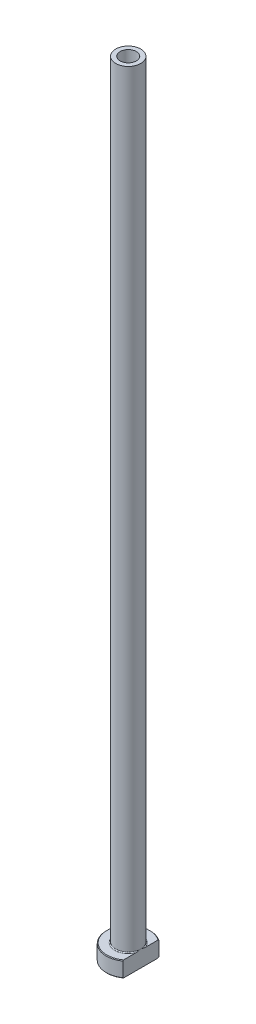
ISO-10303-21;
HEADER;
FILE_DESCRIPTION(('STEP AP214'),'2;1');
FILE_NAME('part.step','',(''),(''),'','','');
FILE_SCHEMA(('AUTOMOTIVE_DESIGN { 1 0 10303 214 1 1 1 1 }'));
ENDSEC;
DATA;
#1=APPLICATION_CONTEXT('core data for automotive mechanical design processes');
#2=APPLICATION_PROTOCOL_DEFINITION('international standard','automotive_design',2000,#1);
#3=PRODUCT_CONTEXT('',#1,'mechanical');
#4=PRODUCT('Part','Part','',(#3));
#5=PRODUCT_RELATED_PRODUCT_CATEGORY('part','',(#4));
#6=PRODUCT_DEFINITION_FORMATION('','',#4);
#7=PRODUCT_DEFINITION_CONTEXT('part definition',#1,'design');
#8=PRODUCT_DEFINITION('design','',#6,#7);
#9=PRODUCT_DEFINITION_SHAPE('','',#8);
#10=(LENGTH_UNIT() NAMED_UNIT(*) SI_UNIT(.MILLI.,.METRE.));
#11=(NAMED_UNIT(*) PLANE_ANGLE_UNIT() SI_UNIT($,.RADIAN.));
#12=(NAMED_UNIT(*) SI_UNIT($,.STERADIAN.) SOLID_ANGLE_UNIT());
#13=UNCERTAINTY_MEASURE_WITH_UNIT(LENGTH_MEASURE(1.E-05),#10,'distance_accuracy_value','');
#14=(GEOMETRIC_REPRESENTATION_CONTEXT(3) GLOBAL_UNCERTAINTY_ASSIGNED_CONTEXT((#13)) GLOBAL_UNIT_ASSIGNED_CONTEXT((#10,
#11,#12)) REPRESENTATION_CONTEXT('',''));
#15=CARTESIAN_POINT('',(0.,0.,0.));
#16=DIRECTION('',(0.,0.,1.));
#17=DIRECTION('',(1.,0.,0.));
#18=AXIS2_PLACEMENT_3D('',#15,#16,#17);
#19=CARTESIAN_POINT('',(0.,92.1876809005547,0.));
#20=DIRECTION('',(0.,1.,0.));
#21=DIRECTION('',(0.,0.,1.));
#22=AXIS2_PLACEMENT_3D('',#19,#20,#21);
#23=CYLINDRICAL_SURFACE('',#22,2.60000000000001);
#24=CARTESIAN_POINT('',(0.,250.,0.));
#25=DIRECTION('',(0.,1.,0.));
#26=DIRECTION('',(0.,0.,1.));
#27=AXIS2_PLACEMENT_3D('',#24,#25,#26);
#28=CIRCLE('',#27,2.60000000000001);
#29=CARTESIAN_POINT('',(0.,250.,2.60000000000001));
#30=VERTEX_POINT('',#29);
#31=EDGE_CURVE('E167',#30,#30,#28,.T.);
#32=ORIENTED_EDGE('',*,*,#31,.T.);
#33=EDGE_LOOP('',(#32));
#34=FACE_BOUND('',#33,.T.);
#35=CARTESIAN_POINT('',(0.,205.,0.));
#36=DIRECTION('',(0.,1.,0.));
#37=DIRECTION('',(0.,0.,1.));
#38=AXIS2_PLACEMENT_3D('',#35,#36,#37);
#39=CIRCLE('',#38,2.60000000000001);
#40=CARTESIAN_POINT('',(0.,205.,2.60000000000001));
#41=VERTEX_POINT('',#40);
#42=EDGE_CURVE('E170',#41,#41,#39,.T.);
#43=ORIENTED_EDGE('',*,*,#42,.F.);
#44=EDGE_LOOP('',(#43));
#45=FACE_BOUND('',#44,.T.);
#46=ADVANCED_FACE('F32',(#34,#45),#23,.F.);
#47=CARTESIAN_POINT('',(-2.60000000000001,250.,0.));
#48=DIRECTION('',(0.,1.,0.));
#49=DIRECTION('',(0.,0.,1.));
#50=AXIS2_PLACEMENT_3D('',#47,#48,#49);
#51=PLANE('',#50);
#52=CARTESIAN_POINT('',(0.,250.,0.));
#53=DIRECTION('',(0.,1.,0.));
#54=DIRECTION('',(0.,0.,1.));
#55=AXIS2_PLACEMENT_3D('',#52,#53,#54);
#56=CIRCLE('',#55,4.00000000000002);
#57=CARTESIAN_POINT('',(0.,250.,4.00000000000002));
#58=VERTEX_POINT('',#57);
#59=EDGE_CURVE('E174',#58,#58,#56,.T.);
#60=ORIENTED_EDGE('',*,*,#59,.T.);
#61=EDGE_LOOP('',(#60));
#62=FACE_BOUND('',#61,.T.);
#63=ORIENTED_EDGE('',*,*,#31,.F.);
#64=EDGE_LOOP('',(#63));
#65=FACE_BOUND('',#64,.T.);
#66=ADVANCED_FACE('F157',(#62,#65),#51,.T.);
#67=CARTESIAN_POINT('',(0.,92.1876809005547,0.));
#68=DIRECTION('',(0.,1.,0.));
#69=DIRECTION('',(0.,0.,1.));
#70=AXIS2_PLACEMENT_3D('',#67,#68,#69);
#71=CYLINDRICAL_SURFACE('',#70,4.);
#72=CARTESIAN_POINT('',(0.,5.3,0.));
#73=DIRECTION('',(0.,1.,0.));
#74=DIRECTION('',(0.,0.,1.));
#75=AXIS2_PLACEMENT_3D('',#72,#73,#74);
#76=CIRCLE('',#75,4.);
#77=CARTESIAN_POINT('',(4.,5.3,0.));
#78=VERTEX_POINT('',#77);
#79=EDGE_CURVE('E180',#78,#78,#76,.T.);
#80=ORIENTED_EDGE('',*,*,#79,.T.);
#81=EDGE_LOOP('',(#80));
#82=FACE_BOUND('',#81,.T.);
#83=ORIENTED_EDGE('',*,*,#59,.F.);
#84=EDGE_LOOP('',(#83));
#85=FACE_BOUND('',#84,.T.);
#86=ADVANCED_FACE('F162',(#82,#85),#71,.T.);
#87=CARTESIAN_POINT('',(-3.99999999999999,5.,0.));
#88=DIRECTION('',(0.,1.,0.));
#89=DIRECTION('',(0.,0.,1.));
#90=AXIS2_PLACEMENT_3D('',#87,#88,#89);
#91=PLANE('',#90);
#92=DIRECTION('',(0.,0.,1.));
#93=VECTOR('',#92,1.);
#94=CARTESIAN_POINT('',(4.,5.,0.));
#95=LINE('',#94,#93);
#96=CARTESIAN_POINT('',(4.,5.,-5.49909083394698));
#97=VERTEX_POINT('',#96);
#98=CARTESIAN_POINT('',(4.,5.,-1.57797338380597));
#99=VERTEX_POINT('',#98);
#100=EDGE_CURVE('E54',#97,#99,#95,.T.);
#101=ORIENTED_EDGE('',*,*,#100,.F.);
#102=CARTESIAN_POINT('',(0.,5.,0.));
#103=DIRECTION('',(0.,1.,0.));
#104=DIRECTION('',(0.,0.,1.));
#105=AXIS2_PLACEMENT_3D('',#102,#103,#104);
#106=CIRCLE('',#105,6.79999999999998);
#107=CARTESIAN_POINT('',(3.99999999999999,5.,5.49909083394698));
#108=VERTEX_POINT('',#107);
#109=EDGE_CURVE('E186',#97,#108,#106,.T.);
#110=ORIENTED_EDGE('',*,*,#109,.T.);
#111=CARTESIAN_POINT('',(4.,5.,1.57797338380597));
#112=VERTEX_POINT('',#111);
#113=EDGE_CURVE('E134',#112,#108,#95,.T.);
#114=ORIENTED_EDGE('',*,*,#113,.F.);
#115=CARTESIAN_POINT('',(0.,5.,0.));
#116=DIRECTION('',(0.,1.,0.));
#117=DIRECTION('',(0.,0.,1.));
#118=AXIS2_PLACEMENT_3D('',#115,#116,#117);
#119=CIRCLE('',#118,4.3);
#120=EDGE_CURVE('E183',#112,#99,#119,.F.);
#121=ORIENTED_EDGE('',*,*,#120,.T.);
#122=EDGE_LOOP('',(#101,#110,#114,#121));
#123=FACE_BOUND('',#122,.T.);
#124=ADVANCED_FACE('F197',(#123),#91,.T.);
#125=CARTESIAN_POINT('',(0.,92.1876809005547,0.));
#126=DIRECTION('',(0.,1.,0.));
#127=DIRECTION('',(0.,0.,1.));
#128=AXIS2_PLACEMENT_3D('',#125,#126,#127);
#129=CYLINDRICAL_SURFACE('',#128,6.99999999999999);
#130=DIRECTION('',(0.,-1.,0.));
#131=VECTOR('',#130,1.);
#132=CARTESIAN_POINT('',(3.99999999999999,250.,5.74456264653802));
#133=LINE('',#132,#131);
#134=CARTESIAN_POINT('',(3.99999999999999,4.8,5.74456264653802));
#135=VERTEX_POINT('',#134);
#136=CARTESIAN_POINT('',(3.99999999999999,0.199999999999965,5.74456264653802));
#137=VERTEX_POINT('',#136);
#138=EDGE_CURVE('E82',#135,#137,#133,.T.);
#139=ORIENTED_EDGE('',*,*,#138,.F.);
#140=CARTESIAN_POINT('',(0.,4.8,0.));
#141=DIRECTION('',(0.,1.,0.));
#142=DIRECTION('',(0.,0.,1.));
#143=AXIS2_PLACEMENT_3D('',#140,#141,#142);
#144=CIRCLE('',#143,6.99999999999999);
#145=CARTESIAN_POINT('',(4.,4.8,-5.74456264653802));
#146=VERTEX_POINT('',#145);
#147=EDGE_CURVE('E95',#135,#146,#144,.F.);
#148=ORIENTED_EDGE('',*,*,#147,.T.);
#149=DIRECTION('',(0.,-1.,0.));
#150=VECTOR('',#149,1.);
#151=CARTESIAN_POINT('',(4.,250.,-5.74456264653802));
#152=LINE('',#151,#150);
#153=CARTESIAN_POINT('',(4.,0.199999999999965,-5.74456264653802));
#154=VERTEX_POINT('',#153);
#155=EDGE_CURVE('E192',#146,#154,#152,.T.);
#156=ORIENTED_EDGE('',*,*,#155,.T.);
#157=CARTESIAN_POINT('',(0.,0.199999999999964,0.));
#158=DIRECTION('',(0.,-1.,0.));
#159=DIRECTION('',(0.,0.,-1.));
#160=AXIS2_PLACEMENT_3D('',#157,#158,#159);
#161=CIRCLE('',#160,6.99999999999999);
#162=EDGE_CURVE('E98',#154,#137,#161,.F.);
#163=ORIENTED_EDGE('',*,*,#162,.T.);
#164=EDGE_LOOP('',(#139,#148,#156,#163));
#165=FACE_BOUND('',#164,.T.);
#166=ADVANCED_FACE('F190',(#165),#129,.T.);
#167=CARTESIAN_POINT('',(-6.99999999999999,0.,0.));
#168=DIRECTION('',(0.,-1.,0.));
#169=DIRECTION('',(0.,0.,-1.));
#170=AXIS2_PLACEMENT_3D('',#167,#168,#169);
#171=PLANE('',#170);
#172=CARTESIAN_POINT('',(0.,0.,0.));
#173=DIRECTION('',(0.,-1.,0.));
#174=DIRECTION('',(0.,0.,-1.));
#175=AXIS2_PLACEMENT_3D('',#172,#173,#174);
#176=CIRCLE('',#175,3.34999999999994);
#177=CARTESIAN_POINT('',(0.,0.,-3.34999999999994));
#178=VERTEX_POINT('',#177);
#179=EDGE_CURVE('E40',#178,#178,#176,.F.);
#180=ORIENTED_EDGE('',*,*,#179,.T.);
#181=EDGE_LOOP('',(#180));
#182=FACE_BOUND('',#181,.T.);
#183=DIRECTION('',(0.,0.,-1.));
#184=VECTOR('',#183,1.);
#185=CARTESIAN_POINT('',(3.99999999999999,0.,5.74456264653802));
#186=LINE('',#185,#184);
#187=CARTESIAN_POINT('',(3.99999999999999,0.,5.49909083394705));
#188=VERTEX_POINT('',#187);
#189=CARTESIAN_POINT('',(4.,0.,-5.49909083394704));
#190=VERTEX_POINT('',#189);
#191=EDGE_CURVE('E47',#188,#190,#186,.T.);
#192=ORIENTED_EDGE('',*,*,#191,.F.);
#193=CARTESIAN_POINT('',(0.,0.,0.));
#194=DIRECTION('',(0.,-1.,0.));
#195=DIRECTION('',(0.,0.,-1.));
#196=AXIS2_PLACEMENT_3D('',#193,#194,#195);
#197=CIRCLE('',#196,6.80000000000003);
#198=EDGE_CURVE('E92',#188,#190,#197,.T.);
#199=ORIENTED_EDGE('',*,*,#198,.T.);
#200=EDGE_LOOP('',(#192,#199));
#201=FACE_BOUND('',#200,.T.);
#202=ADVANCED_FACE('F91',(#182,#201),#171,.T.);
#203=CARTESIAN_POINT('',(0.,92.1876809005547,0.));
#204=DIRECTION('',(0.,1.,0.));
#205=DIRECTION('',(0.,0.,1.));
#206=AXIS2_PLACEMENT_3D('',#203,#204,#205);
#207=CYLINDRICAL_SURFACE('',#206,2.85);
#208=CARTESIAN_POINT('',(0.,0.499999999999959,0.));
#209=DIRECTION('',(0.,-1.,0.));
#210=DIRECTION('',(0.,0.,-1.));
#211=AXIS2_PLACEMENT_3D('',#208,#209,#210);
#212=CIRCLE('',#211,2.85);
#213=CARTESIAN_POINT('',(0.,0.499999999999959,-2.85));
#214=VERTEX_POINT('',#213);
#215=EDGE_CURVE('E11',#214,#214,#212,.T.);
#216=ORIENTED_EDGE('',*,*,#215,.T.);
#217=EDGE_LOOP('',(#216));
#218=FACE_BOUND('',#217,.T.);
#219=CARTESIAN_POINT('',(0.,193.,0.));
#220=DIRECTION('',(0.,1.,0.));
#221=DIRECTION('',(0.,0.,1.));
#222=AXIS2_PLACEMENT_3D('',#219,#220,#221);
#223=CIRCLE('',#222,2.85000000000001);
#224=CARTESIAN_POINT('',(0.,193.,2.85000000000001));
#225=VERTEX_POINT('',#224);
#226=EDGE_CURVE('E172',#225,#225,#223,.T.);
#227=ORIENTED_EDGE('',*,*,#226,.T.);
#228=EDGE_LOOP('',(#227));
#229=FACE_BOUND('',#228,.T.);
#230=ADVANCED_FACE('F215',(#218,#229),#207,.F.);
#231=CARTESIAN_POINT('',(0.,193.,0.));
#232=DIRECTION('',(0.,-1.,0.));
#233=DIRECTION('',(0.,0.,-1.));
#234=AXIS2_PLACEMENT_3D('',#231,#232,#233);
#235=CONICAL_SURFACE('',#234,2.85000000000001,0.0208303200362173);
#236=ORIENTED_EDGE('',*,*,#42,.T.);
#237=EDGE_LOOP('',(#236));
#238=FACE_BOUND('',#237,.T.);
#239=ORIENTED_EDGE('',*,*,#226,.F.);
#240=EDGE_LOOP('',(#239));
#241=FACE_BOUND('',#240,.T.);
#242=ADVANCED_FACE('F111',(#238,#241),#235,.F.);
#243=CARTESIAN_POINT('',(0.,5.3,0.));
#244=DIRECTION('',(0.,1.,0.));
#245=DIRECTION('',(0.,0.,1.));
#246=AXIS2_PLACEMENT_3D('',#243,#244,#245);
#247=TOROIDAL_SURFACE('',#246,4.3,0.3);
#248=ORIENTED_EDGE('',*,*,#120,.F.);
#249=CARTESIAN_POINT('',(4.,5.3,0.));
#250=CARTESIAN_POINT('',(4.,5.30000062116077,-1.06261193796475E-10));
#251=CARTESIAN_POINT('',(4.,5.30000124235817,2.17726143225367E-07));
#252=CARTESIAN_POINT('',(4.,5.30000240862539,8.36141170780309E-07));
#253=CARTESIAN_POINT('',(4.,5.30000294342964,1.25011700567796E-06));
#254=CARTESIAN_POINT('',(4.,5.30000404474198,2.23959365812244E-06));
#255=CARTESIAN_POINT('',(4.,5.3000045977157,2.83084496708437E-06));
#256=CARTESIAN_POINT('',(4.,5.3000055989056,4.0651664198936E-06));
#257=CARTESIAN_POINT('',(4.,5.3000060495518,4.70640119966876E-06));
#258=CARTESIAN_POINT('',(4.,5.30000769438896,7.15677270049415E-06));
#259=CARTESIAN_POINT('',(4.,5.30000879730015,9.02996055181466E-06));
#260=CARTESIAN_POINT('',(4.,5.30001063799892,1.27664896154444E-05));
#261=CARTESIAN_POINT('',(4.,5.30001139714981,1.46197814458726E-05));
#262=CARTESIAN_POINT('',(4.,5.30001453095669,2.23679236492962E-05));
#263=CARTESIAN_POINT('',(4.,5.30001683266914,2.8296876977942E-05));
#264=CARTESIAN_POINT('',(4.,5.30002027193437,3.95668753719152E-05));
#265=CARTESIAN_POINT('',(4.,5.30002152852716,4.48715482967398E-05));
#266=CARTESIAN_POINT('',(3.99999999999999,5.30003060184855,8.40118234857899E-05));
#267=CARTESIAN_POINT('',(3.99999999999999,5.30003739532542,0.000118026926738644));
#268=CARTESIAN_POINT('',(4.,5.3000671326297,0.000252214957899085));
#269=CARTESIAN_POINT('',(4.,5.30009559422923,0.0003511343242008));
#270=CARTESIAN_POINT('',(3.99999999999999,5.30020622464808,0.000742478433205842));
#271=CARTESIAN_POINT('',(3.99999999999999,5.30028475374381,0.00103561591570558));
#272=CARTESIAN_POINT('',(4.,5.30059889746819,0.0021992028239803));
#273=CARTESIAN_POINT('',(4.,5.30083905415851,0.00306873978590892));
#274=CARTESIAN_POINT('',(3.99999999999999,5.30183682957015,0.00669141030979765));
#275=CARTESIAN_POINT('',(3.99999999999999,5.30258877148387,0.00944568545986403));
#276=CARTESIAN_POINT('',(4.00000000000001,5.31066890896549,0.0390293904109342));
#277=CARTESIAN_POINT('',(4.,5.31802631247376,0.0658531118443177));
#278=CARTESIAN_POINT('',(3.99999999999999,5.33239676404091,0.118441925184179));
#279=CARTESIAN_POINT('',(3.99999999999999,5.33941183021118,0.144206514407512));
#280=CARTESIAN_POINT('',(4.,5.35427366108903,0.199017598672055));
#281=CARTESIAN_POINT('',(4.,5.3621131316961,0.228066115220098));
#282=CARTESIAN_POINT('',(4.,5.37776349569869,0.286511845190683));
#283=CARTESIAN_POINT('',(4.,5.38557313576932,0.315909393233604));
#284=CARTESIAN_POINT('',(4.,5.40425662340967,0.386994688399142));
#285=CARTESIAN_POINT('',(4.,5.41505237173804,0.428703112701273));
#286=CARTESIAN_POINT('',(4.,5.43592310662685,0.511098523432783));
#287=CARTESIAN_POINT('',(4.,5.44600969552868,0.551782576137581));
#288=CARTESIAN_POINT('',(4.,5.47850986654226,0.686599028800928));
#289=CARTESIAN_POINT('',(4.,5.49978370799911,0.781011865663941));
#290=CARTESIAN_POINT('',(4.,5.53807543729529,0.97184761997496));
#291=CARTESIAN_POINT('',(4.,5.55504273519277,1.0682812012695));
#292=CARTESIAN_POINT('',(4.,5.57582405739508,1.21752725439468));
#293=CARTESIAN_POINT('',(4.,5.58209796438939,1.2699937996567));
#294=CARTESIAN_POINT('',(4.,5.59210686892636,1.37516324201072));
#295=CARTESIAN_POINT('',(4.,5.59584265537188,1.42786606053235));
#296=CARTESIAN_POINT('',(4.,5.60010438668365,1.53310673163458));
#297=CARTESIAN_POINT('',(4.,5.6006487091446,1.58564378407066));
#298=CARTESIAN_POINT('',(4.,5.59767158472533,1.69058605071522));
#299=CARTESIAN_POINT('',(4.,5.59415502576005,1.74299134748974));
#300=CARTESIAN_POINT('',(4.,5.58503062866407,1.81903290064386));
#301=CARTESIAN_POINT('',(4.,5.58157617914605,1.84292934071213));
#302=CARTESIAN_POINT('',(4.,5.57329952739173,1.89051061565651));
#303=CARTESIAN_POINT('',(4.,5.56847619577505,1.91419525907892));
#304=CARTESIAN_POINT('',(4.,5.55726644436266,1.96092888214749));
#305=CARTESIAN_POINT('',(4.,5.55089740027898,1.98398195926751));
#306=CARTESIAN_POINT('',(4.,5.53623434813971,2.0294555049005));
#307=CARTESIAN_POINT('',(4.,5.52794253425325,2.05187666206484));
#308=CARTESIAN_POINT('',(4.,5.50887098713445,2.09590631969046));
#309=CARTESIAN_POINT('',(4.,5.49806837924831,2.11750508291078));
#310=CARTESIAN_POINT('',(4.,5.47333401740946,2.15885583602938));
#311=CARTESIAN_POINT('',(4.,5.45941272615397,2.17861369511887));
#312=CARTESIAN_POINT('',(4.,5.43588221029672,2.20522942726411));
#313=CARTESIAN_POINT('',(4.,5.42781139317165,2.21344043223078));
#314=CARTESIAN_POINT('',(4.,5.41065114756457,2.22875149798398));
#315=CARTESIAN_POINT('',(4.,5.40156129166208,2.23585108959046));
#316=CARTESIAN_POINT('',(4.,5.38220524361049,2.24859694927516));
#317=CARTESIAN_POINT('',(4.,5.3719242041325,2.25422119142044));
#318=CARTESIAN_POINT('',(4.,5.35045072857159,2.26331064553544));
#319=CARTESIAN_POINT('',(4.,5.33926122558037,2.26678251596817));
#320=CARTESIAN_POINT('',(4.,5.31952044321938,2.27051268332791));
#321=CARTESIAN_POINT('',(4.,5.31108453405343,2.27139016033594));
#322=CARTESIAN_POINT('',(4.,5.29418624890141,2.27168963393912));
#323=CARTESIAN_POINT('',(4.,5.28572387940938,2.27111196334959));
#324=CARTESIAN_POINT('',(4.,5.26904138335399,2.26855580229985));
#325=CARTESIAN_POINT('',(4.,5.26082066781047,2.26658107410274));
#326=CARTESIAN_POINT('',(4.,5.24478214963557,2.26139496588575));
#327=CARTESIAN_POINT('',(4.,5.23696461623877,2.25818277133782));
#328=CARTESIAN_POINT('',(4.,5.21851235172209,2.24908332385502));
#329=CARTESIAN_POINT('',(4.,5.20815219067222,2.24264095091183));
#330=CARTESIAN_POINT('',(4.,5.18857975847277,2.22819957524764));
#331=CARTESIAN_POINT('',(4.,5.17937061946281,2.22019647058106));
#332=CARTESIAN_POINT('',(4.,5.15665383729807,2.19777756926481));
#333=CARTESIAN_POINT('',(4.,5.14403484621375,2.18246908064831));
#334=CARTESIAN_POINT('',(4.,5.12118369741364,2.15020843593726));
#335=CARTESIAN_POINT('',(4.,5.11095480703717,2.13325407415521));
#336=CARTESIAN_POINT('',(4.,5.09273574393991,2.09892324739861));
#337=CARTESIAN_POINT('',(4.,5.08468212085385,2.08157988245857));
#338=CARTESIAN_POINT('',(4.,5.07005901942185,2.04627072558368));
#339=CARTESIAN_POINT('',(4.,5.06349101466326,2.02830433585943));
#340=CARTESIAN_POINT('',(4.,5.04555485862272,1.97350761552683));
#341=CARTESIAN_POINT('',(4.,5.03608974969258,1.93605770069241));
#342=CARTESIAN_POINT('',(4.,5.01780569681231,1.84529235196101));
#343=CARTESIAN_POINT('',(4.,5.01077018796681,1.79164082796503));
#344=CARTESIAN_POINT('',(4.,5.00182846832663,1.68379947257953));
#345=CARTESIAN_POINT('',(4.,4.99993887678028,1.62960846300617));
#346=CARTESIAN_POINT('',(4.,5.00006129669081,1.52361204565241));
#347=CARTESIAN_POINT('',(4.,5.00190698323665,1.47180551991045));
#348=CARTESIAN_POINT('',(4.,5.00841243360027,1.36835357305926));
#349=CARTESIAN_POINT('',(4.,5.01307376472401,1.31670825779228));
#350=CARTESIAN_POINT('',(4.,5.02905484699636,1.17431887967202));
#351=CARTESIAN_POINT('',(4.,5.04274090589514,1.08384207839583));
#352=CARTESIAN_POINT('',(4.,5.06701714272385,0.947757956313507));
#353=CARTESIAN_POINT('',(4.,5.07585573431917,0.901814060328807));
#354=CARTESIAN_POINT('',(4.,5.09458665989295,0.810008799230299));
#355=CARTESIAN_POINT('',(4.,5.10448180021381,0.76414800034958));
#356=CARTESIAN_POINT('',(4.,5.12892434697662,0.655631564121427));
#357=CARTESIAN_POINT('',(3.99999999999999,5.14383556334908,0.593058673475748));
#358=CARTESIAN_POINT('',(4.,5.17458762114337,0.46888522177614));
#359=CARTESIAN_POINT('',(4.,5.19041623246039,0.407281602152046));
#360=CARTESIAN_POINT('',(3.99999999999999,5.22090834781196,0.291232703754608));
#361=CARTESIAN_POINT('',(3.99999999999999,5.23550024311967,0.236768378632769));
#362=CARTESIAN_POINT('',(4.,5.26562550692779,0.125604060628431));
#363=CARTESIAN_POINT('',(4.00000000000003,5.28117250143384,0.0689076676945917));
#364=CARTESIAN_POINT('',(3.99999999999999,5.29741226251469,0.00944154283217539));
#365=CARTESIAN_POINT('',(3.99999999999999,5.2981654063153,0.00668315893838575));
#366=CARTESIAN_POINT('',(4.,5.29916346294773,0.00305954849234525));
#367=CARTESIAN_POINT('',(4.,5.29940273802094,0.0021931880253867));
#368=CARTESIAN_POINT('',(3.99999999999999,5.29971580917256,0.00103357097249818));
#369=CARTESIAN_POINT('',(3.99999999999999,5.29979412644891,0.000741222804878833));
#370=CARTESIAN_POINT('',(4.,5.29990450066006,0.000350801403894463));
#371=CARTESIAN_POINT('',(4.,5.29993292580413,0.000252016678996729));
#372=CARTESIAN_POINT('',(3.99999999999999,5.29996263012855,0.000117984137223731));
#373=CARTESIAN_POINT('',(3.99999999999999,5.29996941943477,8.39881926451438E-05));
#374=CARTESIAN_POINT('',(4.,5.29997848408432,4.48674032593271E-05));
#375=CARTESIAN_POINT('',(4.,5.29997973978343,3.95638208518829E-05));
#376=CARTESIAN_POINT('',(4.,5.29998317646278,2.82960353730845E-05));
#377=CARTESIAN_POINT('',(4.,5.29998547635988,2.23681467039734E-05));
#378=CARTESIAN_POINT('',(4.,5.29998860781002,1.46211007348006E-05));
#379=CARTESIAN_POINT('',(4.,5.29998936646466,1.27678906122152E-05));
#380=CARTESIAN_POINT('',(4.,5.29999120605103,9.03144106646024E-06));
#381=CARTESIAN_POINT('',(4.,5.29999230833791,7.15824128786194E-06));
#382=CARTESIAN_POINT('',(4.,5.29999395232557,4.70775547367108E-06));
#383=CARTESIAN_POINT('',(4.,5.29999440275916,4.066464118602E-06));
#384=CARTESIAN_POINT('',(4.,5.29999540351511,2.83199114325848E-06));
#385=CARTESIAN_POINT('',(4.,5.29999595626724,2.24064366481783E-06));
#386=CARTESIAN_POINT('',(4.,5.29999705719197,1.25093989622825E-06));
#387=CARTESIAN_POINT('',(4.,5.29999759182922,8.36841224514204E-07));
#388=CARTESIAN_POINT('',(4.,5.29999875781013,2.18117823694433E-07));
#389=CARTESIAN_POINT('',(4.,5.29999937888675,1.0625427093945E-10));
#390=CARTESIAN_POINT('',(4.,5.3,0.));
#391=B_SPLINE_CURVE_WITH_KNOTS('',3,(#249,#250,#251,#252,#253,#254,#255,#256,#257,#258,#259,
#260,#261,#262,#263,#264,#265,#266,#267,#268,#269,#270,#271,#272,#273,#274,#275,#276,#277,#278,
#279,#280,#281,#282,#283,#284,#285,#286,#287,#288,#289,#290,#291,#292,#293,#294,#295,#296,#297,
#298,#299,#300,#301,#302,#303,#304,#305,#306,#307,#308,#309,#310,#311,#312,#313,#314,#315,#316,
#317,#318,#319,#320,#321,#322,#323,#324,#325,#326,#327,#328,#329,#330,#331,#332,#333,#334,#335,
#336,#337,#338,#339,#340,#341,#342,#343,#344,#345,#346,#347,#348,#349,#350,#351,#352,#353,#354,
#355,#356,#357,#358,#359,#360,#361,#362,#363,#364,#365,#366,#367,#368,#369,#370,#371,#372,#373,
#374,#375,#376,#377,#378,#379,#380,#381,#382,#383,#384,#385,#386,#387,#388,#389,#390),
.UNSPECIFIED.,.T.,.F.,(4,2,2,2,2,2,2,2,2,2,2,2,2,2,2,2,2,2,2,2,2,2,2,2,2,2,2,2,2,2,2,2,2,2,2,2,
2,2,2,2,2,2,2,2,2,2,2,2,2,2,2,2,2,2,2,2,2,2,2,2,2,2,2,2,2,2,2,2,2,2,4),(0.,1.87484342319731E-06,
3.90179894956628E-06,6.31683679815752E-06,8.66651777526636E-06,1.51627533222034E-05,
2.11657906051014E-05,4.02090751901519E-05,5.65429439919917E-05,0.000160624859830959,
0.000469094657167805,0.00137985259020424,0.00408571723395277,0.0126514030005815,
0.0960918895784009,0.176200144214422,0.266463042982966,0.357714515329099,0.486961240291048,
0.612707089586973,0.902988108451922,1.19653589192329,1.35501075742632,1.51343634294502,
1.67094875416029,1.82827177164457,1.90067591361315,1.97313996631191,2.04482437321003,
2.11642737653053,2.18871023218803,2.26075412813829,2.29521947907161,2.32969934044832,
2.36466792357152,2.39952778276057,2.42485422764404,2.45017488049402,2.47542760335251,
2.50069697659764,2.53708899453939,2.57357798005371,2.63276032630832,2.69202310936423,
2.74930315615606,2.8066397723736,2.92223125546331,3.08420752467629,3.24670629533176,
3.40212850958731,3.5576373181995,3.8319296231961,3.97228382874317,4.1130205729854,
4.30598130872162,4.49678885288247,4.66594443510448,4.842306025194,4.85088453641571,
4.85358051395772,4.8544888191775,4.85479687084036,4.85490089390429,4.85491722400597,
4.85493626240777,4.85494226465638,4.85494875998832,4.85495110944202,4.85495352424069,
4.85495555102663,4.8549574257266),.UNSPECIFIED.);
#392=EDGE_CURVE('E126',#112,#78,#391,.T.);
#393=ORIENTED_EDGE('',*,*,#392,.T.);
#394=ORIENTED_EDGE('',*,*,#79,.F.);
#395=CARTESIAN_POINT('',(4.,5.3,0.));
#396=CARTESIAN_POINT('',(4.,5.29999937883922,1.06262399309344E-10));
#397=CARTESIAN_POINT('',(4.,5.29999875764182,-2.17726141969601E-07));
#398=CARTESIAN_POINT('',(4.,5.29999759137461,-8.36141169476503E-07));
#399=CARTESIAN_POINT('',(4.,5.29999705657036,-1.25011700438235E-06));
#400=CARTESIAN_POINT('',(4.,5.29999595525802,-2.23959365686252E-06));
#401=CARTESIAN_POINT('',(4.,5.2999954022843,-2.83084496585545E-06));
#402=CARTESIAN_POINT('',(4.,5.29999440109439,-4.06516641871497E-06));
#403=CARTESIAN_POINT('',(4.,5.2999939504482,-4.70640119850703E-06));
#404=CARTESIAN_POINT('',(4.,5.29999230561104,-7.15677269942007E-06));
#405=CARTESIAN_POINT('',(4.,5.29999120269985,-9.02996055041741E-06));
#406=CARTESIAN_POINT('',(4.,5.29998936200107,-1.2766489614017E-05));
#407=CARTESIAN_POINT('',(4.,5.29998860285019,-1.46197814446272E-05));
#408=CARTESIAN_POINT('',(4.,5.29998546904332,-2.23679236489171E-05));
#409=CARTESIAN_POINT('',(4.,5.29998316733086,-2.82968769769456E-05));
#410=CARTESIAN_POINT('',(4.,5.29997972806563,-3.95668753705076E-05));
#411=CARTESIAN_POINT('',(4.,5.29997847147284,-4.48715482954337E-05));
#412=CARTESIAN_POINT('',(3.99999999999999,5.29996939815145,-8.40118234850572E-05));
#413=CARTESIAN_POINT('',(3.99999999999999,5.29996260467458,-0.000118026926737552));
#414=CARTESIAN_POINT('',(4.,5.2999328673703,-0.000252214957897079));
#415=CARTESIAN_POINT('',(4.,5.29990440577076,-0.000351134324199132));
#416=CARTESIAN_POINT('',(3.99999999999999,5.29979377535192,-0.000742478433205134));
#417=CARTESIAN_POINT('',(3.99999999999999,5.29971524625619,-0.00103561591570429));
#418=CARTESIAN_POINT('',(4.,5.2994011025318,-0.00219920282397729));
#419=CARTESIAN_POINT('',(4.,5.29916094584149,-0.00306873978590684));
#420=CARTESIAN_POINT('',(3.99999999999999,5.29816317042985,-0.00669141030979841));
#421=CARTESIAN_POINT('',(3.99999999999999,5.29741122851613,-0.00944568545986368));
#422=CARTESIAN_POINT('',(4.00000000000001,5.28933109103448,-0.0390293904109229));
#423=CARTESIAN_POINT('',(4.,5.28197368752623,-0.065853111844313));
#424=CARTESIAN_POINT('',(3.99999999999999,5.2676032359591,-0.11844192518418));
#425=CARTESIAN_POINT('',(3.99999999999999,5.26058816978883,-0.144206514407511));
#426=CARTESIAN_POINT('',(4.,5.24572633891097,-0.199017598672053));
#427=CARTESIAN_POINT('',(4.,5.2378868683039,-0.228066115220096));
#428=CARTESIAN_POINT('',(4.,5.22223650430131,-0.286511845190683));
#429=CARTESIAN_POINT('',(4.,5.21442686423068,-0.315909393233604));
#430=CARTESIAN_POINT('',(4.,5.19574337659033,-0.386994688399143));
#431=CARTESIAN_POINT('',(4.,5.18494762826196,-0.428703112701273));
#432=CARTESIAN_POINT('',(4.,5.16407689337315,-0.511098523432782));
#433=CARTESIAN_POINT('',(4.,5.15399030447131,-0.55178257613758));
#434=CARTESIAN_POINT('',(4.,5.12149013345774,-0.686599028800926));
#435=CARTESIAN_POINT('',(4.,5.10021629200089,-0.781011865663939));
#436=CARTESIAN_POINT('',(4.,5.06192456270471,-0.971847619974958));
#437=CARTESIAN_POINT('',(4.,5.04495726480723,-1.06828120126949));
#438=CARTESIAN_POINT('',(4.,5.02417594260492,-1.21752725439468));
#439=CARTESIAN_POINT('',(4.,5.01790203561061,-1.2699937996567));
#440=CARTESIAN_POINT('',(4.,5.00789313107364,-1.37516324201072));
#441=CARTESIAN_POINT('',(4.,5.00415734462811,-1.42786606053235));
#442=CARTESIAN_POINT('',(4.,4.99989561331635,-1.53310673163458));
#443=CARTESIAN_POINT('',(4.,4.9993512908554,-1.58564378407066));
#444=CARTESIAN_POINT('',(4.,5.00232841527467,-1.69058605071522));
#445=CARTESIAN_POINT('',(4.,5.00584497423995,-1.74299134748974));
#446=CARTESIAN_POINT('',(4.,5.01496937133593,-1.81903290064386));
#447=CARTESIAN_POINT('',(4.,5.01842382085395,-1.84292934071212));
#448=CARTESIAN_POINT('',(4.,5.02670047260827,-1.89051061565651));
#449=CARTESIAN_POINT('',(4.,5.03152380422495,-1.91419525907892));
#450=CARTESIAN_POINT('',(4.,5.04273355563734,-1.96092888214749));
#451=CARTESIAN_POINT('',(4.,5.04910259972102,-1.98398195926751));
#452=CARTESIAN_POINT('',(4.,5.06376565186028,-2.02945550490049));
#453=CARTESIAN_POINT('',(4.,5.07205746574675,-2.05187666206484));
#454=CARTESIAN_POINT('',(4.,5.09112901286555,-2.09590631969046));
#455=CARTESIAN_POINT('',(4.,5.10193162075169,-2.11750508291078));
#456=CARTESIAN_POINT('',(4.,5.12666598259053,-2.15885583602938));
#457=CARTESIAN_POINT('',(4.,5.14058727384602,-2.17861369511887));
#458=CARTESIAN_POINT('',(4.,5.16411778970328,-2.20522942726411));
#459=CARTESIAN_POINT('',(4.,5.17218860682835,-2.21344043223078));
#460=CARTESIAN_POINT('',(4.,5.18934885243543,-2.22875149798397));
#461=CARTESIAN_POINT('',(4.,5.19843870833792,-2.23585108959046));
#462=CARTESIAN_POINT('',(4.,5.21779475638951,-2.24859694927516));
#463=CARTESIAN_POINT('',(4.,5.2280757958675,-2.25422119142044));
#464=CARTESIAN_POINT('',(4.,5.24954927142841,-2.26331064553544));
#465=CARTESIAN_POINT('',(4.,5.26073877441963,-2.26678251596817));
#466=CARTESIAN_POINT('',(4.,5.28047955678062,-2.27051268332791));
#467=CARTESIAN_POINT('',(4.,5.28891546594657,-2.27139016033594));
#468=CARTESIAN_POINT('',(4.,5.30581375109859,-2.27168963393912));
#469=CARTESIAN_POINT('',(4.,5.31427612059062,-2.27111196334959));
#470=CARTESIAN_POINT('',(4.,5.33095861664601,-2.26855580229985));
#471=CARTESIAN_POINT('',(4.,5.33917933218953,-2.26658107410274));
#472=CARTESIAN_POINT('',(4.,5.35521785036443,-2.26139496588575));
#473=CARTESIAN_POINT('',(4.,5.36303538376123,-2.25818277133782));
#474=CARTESIAN_POINT('',(4.,5.38148764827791,-2.24908332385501));
#475=CARTESIAN_POINT('',(4.,5.39184780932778,-2.24264095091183));
#476=CARTESIAN_POINT('',(4.,5.41142024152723,-2.22819957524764));
#477=CARTESIAN_POINT('',(4.,5.42062938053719,-2.22019647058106));
#478=CARTESIAN_POINT('',(4.,5.44334616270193,-2.19777756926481));
#479=CARTESIAN_POINT('',(4.,5.45596515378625,-2.18246908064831));
#480=CARTESIAN_POINT('',(4.,5.47881630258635,-2.15020843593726));
#481=CARTESIAN_POINT('',(4.,5.48904519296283,-2.13325407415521));
#482=CARTESIAN_POINT('',(4.,5.50726425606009,-2.09892324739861));
#483=CARTESIAN_POINT('',(4.,5.51531787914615,-2.08157988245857));
#484=CARTESIAN_POINT('',(4.,5.52994098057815,-2.04627072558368));
#485=CARTESIAN_POINT('',(4.,5.53650898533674,-2.02830433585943));
#486=CARTESIAN_POINT('',(4.,5.55444514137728,-1.97350761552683));
#487=CARTESIAN_POINT('',(4.,5.56391025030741,-1.9360577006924));
#488=CARTESIAN_POINT('',(4.,5.58219430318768,-1.845292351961));
#489=CARTESIAN_POINT('',(4.,5.58922981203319,-1.79164082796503));
#490=CARTESIAN_POINT('',(4.,5.59817153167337,-1.68379947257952));
#491=CARTESIAN_POINT('',(4.,5.60006112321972,-1.62960846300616));
#492=CARTESIAN_POINT('',(4.,5.59993870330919,-1.5236120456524));
#493=CARTESIAN_POINT('',(4.,5.59809301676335,-1.47180551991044));
#494=CARTESIAN_POINT('',(4.,5.59158756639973,-1.36835357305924));
#495=CARTESIAN_POINT('',(4.,5.58692623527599,-1.31670825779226));
#496=CARTESIAN_POINT('',(4.,5.57094515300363,-1.17431887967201));
#497=CARTESIAN_POINT('',(4.,5.55725909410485,-1.08384207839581));
#498=CARTESIAN_POINT('',(4.,5.53298285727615,-0.947757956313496));
#499=CARTESIAN_POINT('',(4.,5.52414426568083,-0.901814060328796));
#500=CARTESIAN_POINT('',(4.,5.50541334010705,-0.810008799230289));
#501=CARTESIAN_POINT('',(4.,5.49551819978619,-0.76414800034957));
#502=CARTESIAN_POINT('',(4.,5.47107565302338,-0.655631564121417));
#503=CARTESIAN_POINT('',(3.99999999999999,5.45616443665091,-0.593058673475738));
#504=CARTESIAN_POINT('',(4.,5.42541237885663,-0.468885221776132));
#505=CARTESIAN_POINT('',(4.,5.40958376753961,-0.407281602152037));
#506=CARTESIAN_POINT('',(3.99999999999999,5.37909165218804,-0.2912327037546));
#507=CARTESIAN_POINT('',(3.99999999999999,5.36449975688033,-0.236768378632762));
#508=CARTESIAN_POINT('',(4.,5.33437449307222,-0.125604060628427));
#509=CARTESIAN_POINT('',(4.00000000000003,5.31882749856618,-0.0689076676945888));
#510=CARTESIAN_POINT('',(3.99999999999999,5.30258773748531,-0.00944154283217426));
#511=CARTESIAN_POINT('',(3.99999999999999,5.30183459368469,-0.00668315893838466));
#512=CARTESIAN_POINT('',(4.,5.30083653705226,-0.0030595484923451));
#513=CARTESIAN_POINT('',(4.,5.30059726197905,-0.00219318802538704));
#514=CARTESIAN_POINT('',(3.99999999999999,5.30028419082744,-0.00103357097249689));
#515=CARTESIAN_POINT('',(3.99999999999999,5.30020587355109,-0.000741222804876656));
#516=CARTESIAN_POINT('',(4.,5.30009549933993,-0.000350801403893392));
#517=CARTESIAN_POINT('',(4.,5.30006707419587,-0.000252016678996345));
#518=CARTESIAN_POINT('',(3.99999999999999,5.30003736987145,-0.000117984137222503));
#519=CARTESIAN_POINT('',(3.99999999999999,5.30003058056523,-8.3988192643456E-05));
#520=CARTESIAN_POINT('',(4.,5.30002151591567,-4.48674032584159E-05));
#521=CARTESIAN_POINT('',(4.,5.30002026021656,-3.95638208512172E-05));
#522=CARTESIAN_POINT('',(4.,5.30001682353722,-2.82960353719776E-05));
#523=CARTESIAN_POINT('',(4.,5.30001452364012,-2.23681467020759E-05));
#524=CARTESIAN_POINT('',(4.,5.30001139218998,-1.46211007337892E-05));
#525=CARTESIAN_POINT('',(4.,5.30001063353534,-1.27678906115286E-05));
#526=CARTESIAN_POINT('',(4.,5.30000879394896,-9.03144106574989E-06));
#527=CARTESIAN_POINT('',(4.,5.30000769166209,-7.15824128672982E-06));
#528=CARTESIAN_POINT('',(4.,5.30000604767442,-4.70775547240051E-06));
#529=CARTESIAN_POINT('',(4.,5.30000559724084,-4.06646411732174E-06));
#530=CARTESIAN_POINT('',(4.,5.30000459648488,-2.83199114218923E-06));
#531=CARTESIAN_POINT('',(4.,5.30000404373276,-2.24064366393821E-06));
#532=CARTESIAN_POINT('',(4.,5.30000294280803,-1.25093989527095E-06));
#533=CARTESIAN_POINT('',(4.,5.30000240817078,-8.36841223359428E-07));
#534=CARTESIAN_POINT('',(4.,5.30000124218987,-2.18117822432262E-07));
#535=CARTESIAN_POINT('',(4.,5.30000062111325,-1.06253060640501E-10));
#536=CARTESIAN_POINT('',(4.,5.3,0.));
#537=B_SPLINE_CURVE_WITH_KNOTS('',3,(#395,#396,#397,#398,#399,#400,#401,#402,#403,#404,#405,
#406,#407,#408,#409,#410,#411,#412,#413,#414,#415,#416,#417,#418,#419,#420,#421,#422,#423,#424,
#425,#426,#427,#428,#429,#430,#431,#432,#433,#434,#435,#436,#437,#438,#439,#440,#441,#442,#443,
#444,#445,#446,#447,#448,#449,#450,#451,#452,#453,#454,#455,#456,#457,#458,#459,#460,#461,#462,
#463,#464,#465,#466,#467,#468,#469,#470,#471,#472,#473,#474,#475,#476,#477,#478,#479,#480,#481,
#482,#483,#484,#485,#486,#487,#488,#489,#490,#491,#492,#493,#494,#495,#496,#497,#498,#499,#500,
#501,#502,#503,#504,#505,#506,#507,#508,#509,#510,#511,#512,#513,#514,#515,#516,#517,#518,#519,
#520,#521,#522,#523,#524,#525,#526,#527,#528,#529,#530,#531,#532,#533,#534,#535,#536),
.UNSPECIFIED.,.T.,.F.,(4,2,2,2,2,2,2,2,2,2,2,2,2,2,2,2,2,2,2,2,2,2,2,2,2,2,2,2,2,2,2,2,2,2,2,2,
2,2,2,2,2,2,2,2,2,2,2,2,2,2,2,2,2,2,2,2,2,2,2,2,2,2,2,2,2,2,2,2,2,2,4),(0.,1.87484342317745E-06,
3.90179894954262E-06,6.31683679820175E-06,8.66651777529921E-06,1.5162753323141E-05,
2.11657906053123E-05,4.02090751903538E-05,5.65429439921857E-05,0.000160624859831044,
0.000469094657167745,0.00137985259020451,0.0040857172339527,0.0126514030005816,
0.0960918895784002,0.17620014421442,0.266463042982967,0.357714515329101,0.48696124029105,
0.612707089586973,0.902988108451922,1.19653589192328,1.35501075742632,1.51343634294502,
1.67094875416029,1.82827177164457,1.90067591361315,1.97313996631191,2.04482437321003,
2.11642737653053,2.18871023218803,2.26075412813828,2.29521947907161,2.32969934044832,
2.36466792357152,2.39952778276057,2.42485422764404,2.45017488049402,2.47542760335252,
2.50069697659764,2.53708899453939,2.57357798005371,2.63276032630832,2.69202310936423,
2.74930315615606,2.8066397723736,2.92223125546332,3.08420752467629,3.24670629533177,
3.40212850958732,3.55763731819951,3.83192962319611,3.97228382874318,4.1130205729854,
4.30598130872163,4.49678885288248,4.66594443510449,4.842306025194,4.85088453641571,
4.85358051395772,4.8544888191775,4.85479687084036,4.85490089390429,4.85491722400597,
4.85493626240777,4.85494226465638,4.85494875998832,4.85495110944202,4.85495352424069,
4.85495555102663,4.8549574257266),.UNSPECIFIED.);
#538=EDGE_CURVE('E135',#78,#99,#537,.T.);
#539=ORIENTED_EDGE('',*,*,#538,.T.);
#540=EDGE_LOOP('',(#248,#393,#394,#539));
#541=FACE_BOUND('',#540,.T.);
#542=ADVANCED_FACE('F141',(#541),#247,.F.);
#543=CARTESIAN_POINT('',(0.,5.,0.));
#544=DIRECTION('',(0.,-1.,0.));
#545=DIRECTION('',(0.,0.,-1.));
#546=AXIS2_PLACEMENT_3D('',#543,#544,#545);
#547=CONICAL_SURFACE('',#546,6.79999999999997,0.785398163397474);
#548=CARTESIAN_POINT('',(4.,-1.45712845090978,-12.6392822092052));
#549=CARTESIAN_POINT('',(4.,-1.24364466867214,-12.4153556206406));
#550=CARTESIAN_POINT('',(4.,-1.03042430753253,-12.1911774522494));
#551=CARTESIAN_POINT('',(4.,-0.604617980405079,-11.7422167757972));
#552=CARTESIAN_POINT('',(4.,-0.392032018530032,-11.5174342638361));
#553=CARTESIAN_POINT('',(4.,0.0324624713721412,-11.0670952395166));
#554=CARTESIAN_POINT('',(4.,0.244370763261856,-10.8415385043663));
#555=CARTESIAN_POINT('',(4.,0.667290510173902,-10.3895875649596));
#556=CARTESIAN_POINT('',(4.,0.878301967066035,-10.1631933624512));
#557=CARTESIAN_POINT('',(4.,1.5138537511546,-9.47810122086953));
#558=CARTESIAN_POINT('',(4.,1.93676291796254,-9.01788214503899));
#559=CARTESIAN_POINT('',(4.,2.56612335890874,-8.32309905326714));
#560=CARTESIAN_POINT('',(4.,2.77505666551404,-8.0907845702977));
#561=CARTESIAN_POINT('',(4.,3.19080254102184,-7.62426940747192));
#562=CARTESIAN_POINT('',(4.,3.39761512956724,-7.39006874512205));
#563=CARTESIAN_POINT('',(4.,3.87870763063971,-6.838918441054));
#564=CARTESIAN_POINT('',(4.,4.15190978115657,-6.52102188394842));
#565=CARTESIAN_POINT('',(4.,4.55642425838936,-6.03960901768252));
#566=CARTESIAN_POINT('',(4.,4.69041050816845,-5.87833992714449));
#567=CARTESIAN_POINT('',(4.,4.95616531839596,-5.5539846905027));
#568=CARTESIAN_POINT('',(4.,5.08793391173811,-5.39089857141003));
#569=CARTESIAN_POINT('',(4.,5.34841712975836,-5.06288801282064));
#570=CARTESIAN_POINT('',(4.,5.47713786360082,-4.89796843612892));
#571=CARTESIAN_POINT('',(4.,5.73107494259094,-4.56545535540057));
#572=CARTESIAN_POINT('',(4.,5.85629144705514,-4.39786197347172));
#573=CARTESIAN_POINT('',(4.,6.10211465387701,-4.05948444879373));
#574=CARTESIAN_POINT('',(4.,6.22272435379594,-3.8887024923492));
#575=CARTESIAN_POINT('',(4.,6.45796076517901,-3.54308312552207));
#576=CARTESIAN_POINT('',(4.,6.57258867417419,-3.36824653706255));
#577=CARTESIAN_POINT('',(4.,6.76866603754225,-3.05381396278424));
#578=CARTESIAN_POINT('',(4.,6.85173773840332,-2.91523359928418));
#579=CARTESIAN_POINT('',(4.,7.01174537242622,-2.63451965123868));
#580=CARTESIAN_POINT('',(4.,7.0886804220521,-2.49238555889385));
#581=CARTESIAN_POINT('',(4.,7.2345943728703,-2.20416961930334));
#582=CARTESIAN_POINT('',(4.,7.30357836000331,-2.05809037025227));
#583=CARTESIAN_POINT('',(4.,7.43135520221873,-1.76151732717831));
#584=CARTESIAN_POINT('',(4.,7.49015114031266,-1.61102488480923));
#585=CARTESIAN_POINT('',(4.,7.58249315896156,-1.34142099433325));
#586=CARTESIAN_POINT('',(4.,7.61872660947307,-1.22323501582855));
#587=CARTESIAN_POINT('',(4.,7.68223354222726,-0.98449286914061));
#588=CARTESIAN_POINT('',(4.,7.70951040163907,-0.863937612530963));
#589=CARTESIAN_POINT('',(4.,7.75377914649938,-0.621342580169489));
#590=CARTESIAN_POINT('',(4.,7.77080509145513,-0.499309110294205));
#591=CARTESIAN_POINT('',(4.,7.79378778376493,-0.254194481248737));
#592=CARTESIAN_POINT('',(4.,7.79974523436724,-0.131113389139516));
#593=CARTESIAN_POINT('',(4.,7.80023957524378,0.115517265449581));
#594=CARTESIAN_POINT('',(4.,7.79473514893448,0.239066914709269));
#595=CARTESIAN_POINT('',(4.,7.77255119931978,0.485148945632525));
#596=CARTESIAN_POINT('',(4.,7.75587091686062,0.607681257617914));
#597=CARTESIAN_POINT('',(4.,7.71218353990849,0.851269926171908));
#598=CARTESIAN_POINT('',(4.,7.68514362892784,0.972320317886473));
#599=CARTESIAN_POINT('',(4.,7.6220120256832,1.21200276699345));
#600=CARTESIAN_POINT('',(4.,7.58591962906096,1.33063463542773));
#601=CARTESIAN_POINT('',(4.,7.4598007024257,1.70122439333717));
#602=CARTESIAN_POINT('',(4.,7.35572950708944,1.94843335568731));
#603=CARTESIAN_POINT('',(4.,7.18186715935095,2.31048534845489));
#604=CARTESIAN_POINT('',(4.,7.12087684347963,2.42983561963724));
#605=CARTESIAN_POINT('',(4.,6.99403531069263,2.66593629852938));
#606=CARTESIAN_POINT('',(3.99999999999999,6.92818466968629,2.78268701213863));
#607=CARTESIAN_POINT('',(3.99999999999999,6.79157875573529,3.01550895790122));
#608=CARTESIAN_POINT('',(3.99999999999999,6.72076681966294,3.13154660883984));
#609=CARTESIAN_POINT('',(3.99999999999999,6.57583116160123,3.36153379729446));
#610=CARTESIAN_POINT('',(3.99999999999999,6.50170736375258,3.47548328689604));
#611=CARTESIAN_POINT('',(3.99999999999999,6.35080982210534,3.70145107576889));
#612=CARTESIAN_POINT('',(3.99999999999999,6.27403866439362,3.81347110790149));
#613=CARTESIAN_POINT('',(3.99999999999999,6.11824120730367,4.03592316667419));
#614=CARTESIAN_POINT('',(3.99999999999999,6.03921496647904,4.14635523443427));
#615=CARTESIAN_POINT('',(3.99999999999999,5.81506547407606,4.45397159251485));
#616=CARTESIAN_POINT('',(3.99999999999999,5.66782256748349,4.64961120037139));
#617=CARTESIAN_POINT('',(3.99999999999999,5.36880597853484,5.03740600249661));
#618=CARTESIAN_POINT('',(3.99999999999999,5.21703183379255,5.22956083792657));
#619=CARTESIAN_POINT('',(3.99999999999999,4.90999105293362,5.61115465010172));
#620=CARTESIAN_POINT('',(3.99999999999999,4.75472331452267,5.80059273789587));
#621=CARTESIAN_POINT('',(3.99999999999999,4.4415075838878,6.17724364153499));
#622=CARTESIAN_POINT('',(3.99999999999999,4.28355951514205,6.36445639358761));
#623=CARTESIAN_POINT('',(3.99999999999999,3.9652580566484,6.73740614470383));
#624=CARTESIAN_POINT('',(3.99999999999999,3.80490084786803,6.92313987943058));
#625=CARTESIAN_POINT('',(3.99999999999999,3.48247055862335,7.29311320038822));
#626=CARTESIAN_POINT('',(3.99999999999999,3.32039746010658,7.47735277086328));
#627=CARTESIAN_POINT('',(3.99999999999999,2.83216188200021,8.02814826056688));
#628=CARTESIAN_POINT('',(3.99999999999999,2.50391696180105,8.39285790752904));
#629=CARTESIAN_POINT('',(3.99999999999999,1.87512078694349,9.08414492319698));
#630=CARTESIAN_POINT('',(3.99999999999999,1.57491666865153,9.41103929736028));
#631=CARTESIAN_POINT('',(3.99999999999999,0.972153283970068,10.0626830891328));
#632=CARTESIAN_POINT('',(3.99999999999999,0.669593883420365,10.3874323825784));
#633=CARTESIAN_POINT('',(3.99999999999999,0.0637759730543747,11.0341169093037));
#634=CARTESIAN_POINT('',(3.99999999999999,-0.239476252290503,11.3560580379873));
#635=CARTESIAN_POINT('',(3.99999999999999,-0.847356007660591,11.9985921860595));
#636=CARTESIAN_POINT('',(3.99999999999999,-1.15198342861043,12.3191853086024));
#637=CARTESIAN_POINT('',(3.99999999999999,-1.45712845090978,12.6392822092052));
#638=B_SPLINE_CURVE_WITH_KNOTS('',3,(#548,#549,#550,#551,#552,#553,#554,#555,#556,#557,#558,
#559,#560,#561,#562,#563,#564,#565,#566,#567,#568,#569,#570,#571,#572,#573,#574,#575,#576,#577,
#578,#579,#580,#581,#582,#583,#584,#585,#586,#587,#588,#589,#590,#591,#592,#593,#594,#595,#596,
#597,#598,#599,#600,#601,#602,#603,#604,#605,#606,#607,#608,#609,#610,#611,#612,#613,#614,#615,
#616,#617,#618,#619,#620,#621,#622,#623,#624,#625,#626,#627,#628,#629,#630,#631,#632,#633,#634,
#635,#636,#637),.UNSPECIFIED.,.F.,.F.,(4,2,2,2,2,2,2,2,2,2,2,2,2,2,2,2,2,2,2,2,2,2,2,2,2,2,2,2,
2,2,2,2,2,2,2,2,2,2,2,2,2,2,2,2,4),(0.,0.928152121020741,1.85631024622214,2.78476262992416,
3.71321307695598,5.5882303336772,6.52556078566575,7.46288254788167,8.72028576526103,
9.349270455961,9.97824580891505,10.6058302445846,11.2333861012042,11.8605264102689,
12.4875406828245,12.9721363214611,13.4568016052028,13.9411551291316,14.4253618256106,
14.7959147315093,15.1663277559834,15.535503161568,15.9046551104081,16.2751400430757,
16.645650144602,17.017343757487,17.3890663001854,18.1913996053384,18.5934522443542,
18.9954573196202,19.4032100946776,19.8109722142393,20.218346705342,20.6257106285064,
21.3601838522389,22.0947322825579,22.829515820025,23.5643203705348,24.3004480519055,
25.0365834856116,26.508549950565,27.8400191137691,29.1715646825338,30.4983881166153,
31.8251080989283),.UNSPECIFIED.);
#639=EDGE_CURVE('E133',#146,#97,#638,.T.);
#640=ORIENTED_EDGE('',*,*,#639,.F.);
#641=ORIENTED_EDGE('',*,*,#147,.F.);
#642=EDGE_CURVE('E118',#108,#135,#638,.T.);
#643=ORIENTED_EDGE('',*,*,#642,.F.);
#644=ORIENTED_EDGE('',*,*,#109,.F.);
#645=EDGE_LOOP('',(#640,#641,#643,#644));
#646=FACE_BOUND('',#645,.T.);
#647=ADVANCED_FACE('F145',(#646),#547,.T.);
#648=CARTESIAN_POINT('',(0.,0.199999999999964,0.));
#649=DIRECTION('',(0.,1.,0.));
#650=DIRECTION('',(0.,0.,1.));
#651=AXIS2_PLACEMENT_3D('',#648,#649,#650);
#652=CONICAL_SURFACE('',#651,6.99999999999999,0.78539816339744);
#653=CARTESIAN_POINT('',(3.99999999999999,6.45712845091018,12.6392822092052));
#654=CARTESIAN_POINT('',(3.99999999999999,6.24364466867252,12.4153556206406));
#655=CARTESIAN_POINT('',(3.99999999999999,6.0304243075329,12.1911774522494));
#656=CARTESIAN_POINT('',(3.99999999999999,5.60461798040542,11.7422167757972));
#657=CARTESIAN_POINT('',(3.99999999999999,5.39203201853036,11.5174342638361));
#658=CARTESIAN_POINT('',(3.99999999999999,4.96753752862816,11.0670952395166));
#659=CARTESIAN_POINT('',(3.99999999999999,4.75562923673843,10.8415385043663));
#660=CARTESIAN_POINT('',(3.99999999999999,4.33270948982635,10.3895875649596));
#661=CARTESIAN_POINT('',(3.99999999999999,4.12169803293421,10.1631933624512));
#662=CARTESIAN_POINT('',(3.99999999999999,3.4861462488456,9.47810122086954));
#663=CARTESIAN_POINT('',(3.99999999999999,3.06323708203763,9.01788214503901));
#664=CARTESIAN_POINT('',(3.99999999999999,2.43387664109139,8.32309905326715));
#665=CARTESIAN_POINT('',(3.99999999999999,2.22494333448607,8.09078457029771));
#666=CARTESIAN_POINT('',(3.99999999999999,1.80919745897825,7.62426940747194));
#667=CARTESIAN_POINT('',(3.99999999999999,1.60238487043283,7.39006874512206));
#668=CARTESIAN_POINT('',(3.99999999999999,1.12129236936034,6.83891844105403));
#669=CARTESIAN_POINT('',(3.99999999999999,0.848090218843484,6.52102188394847));
#670=CARTESIAN_POINT('',(3.99999999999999,0.443575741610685,6.0396090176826));
#671=CARTESIAN_POINT('',(3.99999999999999,0.309589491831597,5.87833992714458));
#672=CARTESIAN_POINT('',(3.99999999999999,0.0438346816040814,5.55398469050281));
#673=CARTESIAN_POINT('',(3.99999999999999,-0.0879339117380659,5.39089857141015));
#674=CARTESIAN_POINT('',(3.99999999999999,-0.348417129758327,5.06288801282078));
#675=CARTESIAN_POINT('',(3.99999999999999,-0.477137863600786,4.89796843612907));
#676=CARTESIAN_POINT('',(3.99999999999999,-0.731074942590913,4.56545535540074));
#677=CARTESIAN_POINT('',(3.99999999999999,-0.856291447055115,4.3978619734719));
#678=CARTESIAN_POINT('',(3.99999999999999,-1.10211465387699,4.05948444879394));
#679=CARTESIAN_POINT('',(3.99999999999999,-1.22272435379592,3.88870249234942));
#680=CARTESIAN_POINT('',(3.99999999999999,-1.457960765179,3.54308312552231));
#681=CARTESIAN_POINT('',(3.99999999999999,-1.57258867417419,3.3682465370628));
#682=CARTESIAN_POINT('',(3.99999999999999,-1.76866603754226,3.05381396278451));
#683=CARTESIAN_POINT('',(4.,-1.85173773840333,2.91523359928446));
#684=CARTESIAN_POINT('',(4.,-2.01174537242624,2.63451965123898));
#685=CARTESIAN_POINT('',(4.,-2.08868042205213,2.49238555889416));
#686=CARTESIAN_POINT('',(4.,-2.23459437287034,2.20416961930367));
#687=CARTESIAN_POINT('',(4.,-2.30357836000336,2.05809037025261));
#688=CARTESIAN_POINT('',(4.,-2.4313552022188,1.76151732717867));
#689=CARTESIAN_POINT('',(4.,-2.49015114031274,1.61102488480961));
#690=CARTESIAN_POINT('',(4.,-2.58249315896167,1.34142099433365));
#691=CARTESIAN_POINT('',(4.,-2.61872660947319,1.22323501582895));
#692=CARTESIAN_POINT('',(4.,-2.6822335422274,0.984492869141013));
#693=CARTESIAN_POINT('',(4.,-2.70951040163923,0.863937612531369));
#694=CARTESIAN_POINT('',(4.,-2.75377914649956,0.621342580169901));
#695=CARTESIAN_POINT('',(4.,-2.77080509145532,0.499309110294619));
#696=CARTESIAN_POINT('',(4.,-2.79378778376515,0.254194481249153));
#697=CARTESIAN_POINT('',(4.,-2.79974523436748,0.131113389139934));
#698=CARTESIAN_POINT('',(4.,-2.80023957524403,-0.115517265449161));
#699=CARTESIAN_POINT('',(4.,-2.79473514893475,-0.23906691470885));
#700=CARTESIAN_POINT('',(4.,-2.77255119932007,-0.485148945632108));
#701=CARTESIAN_POINT('',(4.,-2.75587091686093,-0.6076812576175));
#702=CARTESIAN_POINT('',(4.,-2.71218353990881,-0.851269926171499));
#703=CARTESIAN_POINT('',(4.,-2.68514362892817,-0.972320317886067));
#704=CARTESIAN_POINT('',(4.,-2.62201202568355,-1.21200276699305));
#705=CARTESIAN_POINT('',(4.,-2.58591962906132,-1.33063463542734));
#706=CARTESIAN_POINT('',(4.,-2.4598007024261,-1.70122439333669));
#707=CARTESIAN_POINT('',(4.,-2.35572950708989,-1.94843335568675));
#708=CARTESIAN_POINT('',(4.,-2.18186715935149,-2.31048534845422));
#709=CARTESIAN_POINT('',(4.,-2.1208768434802,-2.42983561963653));
#710=CARTESIAN_POINT('',(4.,-1.99403531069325,-2.6659362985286));
#711=CARTESIAN_POINT('',(4.,-1.92818466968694,-2.78268701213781));
#712=CARTESIAN_POINT('',(4.,-1.79157875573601,-3.01550895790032));
#713=CARTESIAN_POINT('',(4.,-1.72076681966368,-3.13154660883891));
#714=CARTESIAN_POINT('',(4.,-1.57583116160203,-3.36153379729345));
#715=CARTESIAN_POINT('',(4.,-1.50170736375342,-3.475483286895));
#716=CARTESIAN_POINT('',(4.,-1.35080982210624,-3.70145107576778));
#717=CARTESIAN_POINT('',(4.,-1.27403866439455,-3.81347110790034));
#718=CARTESIAN_POINT('',(4.,-1.11824120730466,-4.03592316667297));
#719=CARTESIAN_POINT('',(4.,-1.03921496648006,-4.14635523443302));
#720=CARTESIAN_POINT('',(4.,-0.815065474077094,-4.45397159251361));
#721=CARTESIAN_POINT('',(4.,-0.667822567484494,-4.6496112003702));
#722=CARTESIAN_POINT('',(4.,-0.368805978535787,-5.03740600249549));
#723=CARTESIAN_POINT('',(4.,-0.217031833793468,-5.22956083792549));
#724=CARTESIAN_POINT('',(4.,0.0900089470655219,-5.61115465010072));
#725=CARTESIAN_POINT('',(4.,0.245276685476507,-5.80059273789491));
#726=CARTESIAN_POINT('',(4.,0.558492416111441,-6.1772436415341));
#727=CARTESIAN_POINT('',(4.,0.716440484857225,-6.36445639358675));
#728=CARTESIAN_POINT('',(4.,1.03474194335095,-6.73740614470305));
#729=CARTESIAN_POINT('',(4.,1.19509915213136,-6.92313987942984));
#730=CARTESIAN_POINT('',(4.,1.51752944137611,-7.29311320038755));
#731=CARTESIAN_POINT('',(4.,1.67960253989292,-7.47735277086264));
#732=CARTESIAN_POINT('',(4.,2.16783811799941,-8.02814826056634));
#733=CARTESIAN_POINT('',(4.,2.49608303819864,-8.39285790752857));
#734=CARTESIAN_POINT('',(4.,3.12487921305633,-9.08414492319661));
#735=CARTESIAN_POINT('',(4.,3.42508333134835,-9.41103929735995));
#736=CARTESIAN_POINT('',(4.,4.02784671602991,-10.0626830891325));
#737=CARTESIAN_POINT('',(4.,4.33040611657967,-10.3874323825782));
#738=CARTESIAN_POINT('',(4.,4.93622402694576,-11.0341169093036));
#739=CARTESIAN_POINT('',(4.,5.23947625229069,-11.3560580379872));
#740=CARTESIAN_POINT('',(4.,5.84735600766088,-11.9985921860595));
#741=CARTESIAN_POINT('',(4.,6.15198342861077,-12.3191853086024));
#742=CARTESIAN_POINT('',(4.,6.45712845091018,-12.6392822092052));
#743=B_SPLINE_CURVE_WITH_KNOTS('',3,(#653,#654,#655,#656,#657,#658,#659,#660,#661,#662,#663,
#664,#665,#666,#667,#668,#669,#670,#671,#672,#673,#674,#675,#676,#677,#678,#679,#680,#681,#682,
#683,#684,#685,#686,#687,#688,#689,#690,#691,#692,#693,#694,#695,#696,#697,#698,#699,#700,#701,
#702,#703,#704,#705,#706,#707,#708,#709,#710,#711,#712,#713,#714,#715,#716,#717,#718,#719,#720,
#721,#722,#723,#724,#725,#726,#727,#728,#729,#730,#731,#732,#733,#734,#735,#736,#737,#738,#739,
#740,#741,#742),.UNSPECIFIED.,.F.,.F.,(4,2,2,2,2,2,2,2,2,2,2,2,2,2,2,2,2,2,2,2,2,2,2,2,2,2,2,2,
2,2,2,2,2,2,2,2,2,2,2,2,2,2,2,2,4),(0.,0.928152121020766,1.8563102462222,2.78476262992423,
3.71321307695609,5.58823033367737,6.52556078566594,7.46288254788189,8.72028576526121,
9.34927045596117,9.97824580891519,10.6058302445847,11.2333861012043,11.860526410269,
12.4875406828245,12.9721363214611,13.4568016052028,13.9411551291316,14.4253618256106,
14.7959147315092,15.1663277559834,15.535503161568,15.9046551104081,16.2751400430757,
16.645650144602,17.017343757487,17.3890663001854,18.1913996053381,18.5934522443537,
18.9954573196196,19.4032100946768,19.8109722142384,20.218346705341,20.6257106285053,
21.3601838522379,22.0947322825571,22.8295158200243,23.5643203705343,24.3004480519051,
25.0365834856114,26.5085499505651,27.8400191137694,29.1715646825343,30.4983881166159,
31.8251080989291),.UNSPECIFIED.);
#744=EDGE_CURVE('E79',#137,#188,#743,.T.);
#745=ORIENTED_EDGE('',*,*,#744,.F.);
#746=ORIENTED_EDGE('',*,*,#162,.F.);
#747=EDGE_CURVE('E87',#190,#154,#743,.T.);
#748=ORIENTED_EDGE('',*,*,#747,.F.);
#749=ORIENTED_EDGE('',*,*,#198,.F.);
#750=EDGE_LOOP('',(#745,#746,#748,#749));
#751=FACE_BOUND('',#750,.T.);
#752=ADVANCED_FACE('F94',(#751),#652,.T.);
#753=CARTESIAN_POINT('',(3.99999999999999,250.,5.74456264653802));
#754=DIRECTION('',(-1.,0.,0.));
#755=DIRECTION('',(0.,0.,1.));
#756=AXIS2_PLACEMENT_3D('',#753,#754,#755);
#757=PLANE('',#756);
#758=ORIENTED_EDGE('',*,*,#392,.F.);
#759=ORIENTED_EDGE('',*,*,#113,.T.);
#760=ORIENTED_EDGE('',*,*,#642,.T.);
#761=ORIENTED_EDGE('',*,*,#138,.T.);
#762=ORIENTED_EDGE('',*,*,#744,.T.);
#763=ORIENTED_EDGE('',*,*,#191,.T.);
#764=ORIENTED_EDGE('',*,*,#747,.T.);
#765=ORIENTED_EDGE('',*,*,#155,.F.);
#766=ORIENTED_EDGE('',*,*,#639,.T.);
#767=ORIENTED_EDGE('',*,*,#100,.T.);
#768=ORIENTED_EDGE('',*,*,#538,.F.);
#769=EDGE_LOOP('',(#758,#759,#760,#761,#762,#763,#764,#765,#766,#767,#768));
#770=FACE_BOUND('',#769,.T.);
#771=ADVANCED_FACE('F80',(#770),#757,.F.);
#772=CARTESIAN_POINT('',(0.,0.,0.));
#773=DIRECTION('',(0.,-1.,0.));
#774=DIRECTION('',(0.,0.,-1.));
#775=AXIS2_PLACEMENT_3D('',#772,#773,#774);
#776=CONICAL_SURFACE('',#775,3.34999999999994,0.785398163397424);
#777=ORIENTED_EDGE('',*,*,#215,.F.);
#778=EDGE_LOOP('',(#777));
#779=FACE_BOUND('',#778,.T.);
#780=ORIENTED_EDGE('',*,*,#179,.F.);
#781=EDGE_LOOP('',(#780));
#782=FACE_BOUND('',#781,.T.);
#783=ADVANCED_FACE('F34',(#779,#782),#776,.F.);
#784=CLOSED_SHELL('',(#46,#66,#86,#124,#166,#202,#230,#242,#542,#647,#752,#771,#783));
#785=MANIFOLD_SOLID_BREP('B2',#784);
#786=ADVANCED_BREP_SHAPE_REPRESENTATION('',(#18,#785),#14);
#787=SHAPE_DEFINITION_REPRESENTATION(#9,#786);
ENDSEC;
END-ISO-10303-21;
